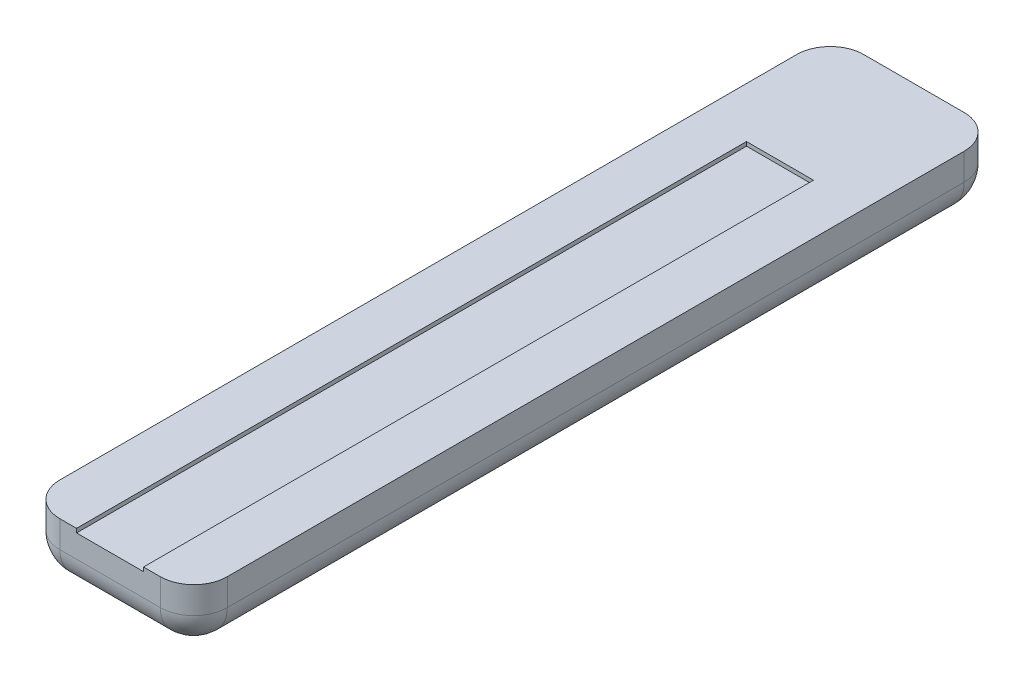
from build123d import *

# Parameters (mm, degrees)
SKETCH1_W          = 31.75
SKETCH1_H          = 152.4
EXTRUDE1_DEPTH     = 11.43
FILLET1_R          = 6.35
FILLET2_R          = 6.35
SKETCH2_W          = 12.7
SKETCH2_H          = 127
CUT_EXTRUDE1_DEPTH = 0.762


with BuildPart() as part:
    # Sketch1 → Extrude1 (new body)
    with BuildSketch(Plane(origin=(0, 0, 0), x_dir=(1, 0, 0), z_dir=(0, 1, 0))):
        with Locations((0, 76.2)):
            Rectangle(SKETCH1_W, SKETCH1_H)
    extrude(amount=-EXTRUDE1_DEPTH)

    # Fillet1
    fillet1_edges = [part.edges().sort_by_distance(p)[0] for p in [
        (-15.875, -5.715, -152.4),
        (15.875, -5.715, -152.4),
        (15.875, -5.715, 0),
        (-15.875, -5.715, 0),
    ]]
    fillet(fillet1_edges, radius=FILLET1_R)

    # Fillet2
    fillet2_edges = [part.edges().sort_by_distance(p)[0] for p in [
        (15.875, -11.43, -76.2),
        (0, -11.43, -152.4),
        (-15.875, -11.43, -76.2),
        (0, -11.43, 0),
        (14.015128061, -11.43, -1.859871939),
        (-14.015128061, -11.43, -1.859871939),
        (-14.015128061, -11.43, -150.540128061),
        (14.015128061, -11.43, -150.540128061),
    ]]
    fillet(fillet2_edges, radius=FILLET2_R)

    # Sketch2 → Cut-Extrude1 (cut)
    with BuildSketch(Plane(origin=(0, 0, 0), x_dir=(1, 0, 0), z_dir=(0, 1, 0))):
        with Locations((0, 63.5)):
            Rectangle(SKETCH2_W, SKETCH2_H)
    extrude(amount=-CUT_EXTRUDE1_DEPTH, mode=Mode.SUBTRACT)


solid = part.part
